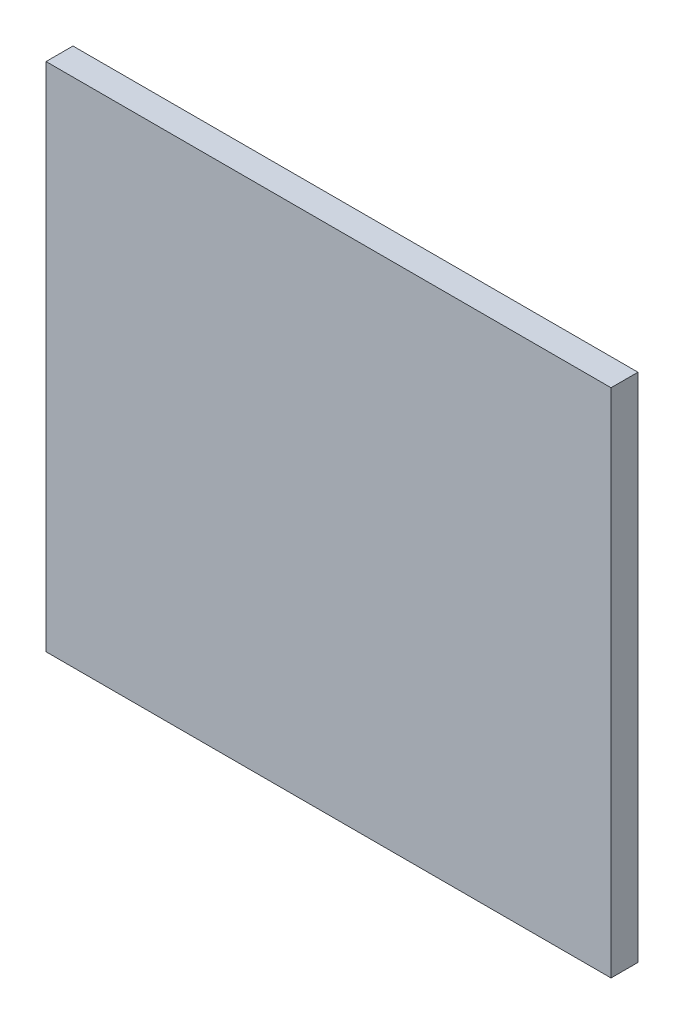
from build123d import *

# Parameters (mm, degrees)
ESQUISSE1_W      = 126
ESQUISSE1_H      = 114
EXTRUSION1_DEPTH = 6


with BuildPart() as part:
    # Esquisse1 → Extrusion1 (new body)
    with BuildSketch(Plane.XY):
        with Locations((13, -17)):
            Rectangle(ESQUISSE1_W, ESQUISSE1_H)
    extrude(amount=EXTRUSION1_DEPTH)


solid = part.part
